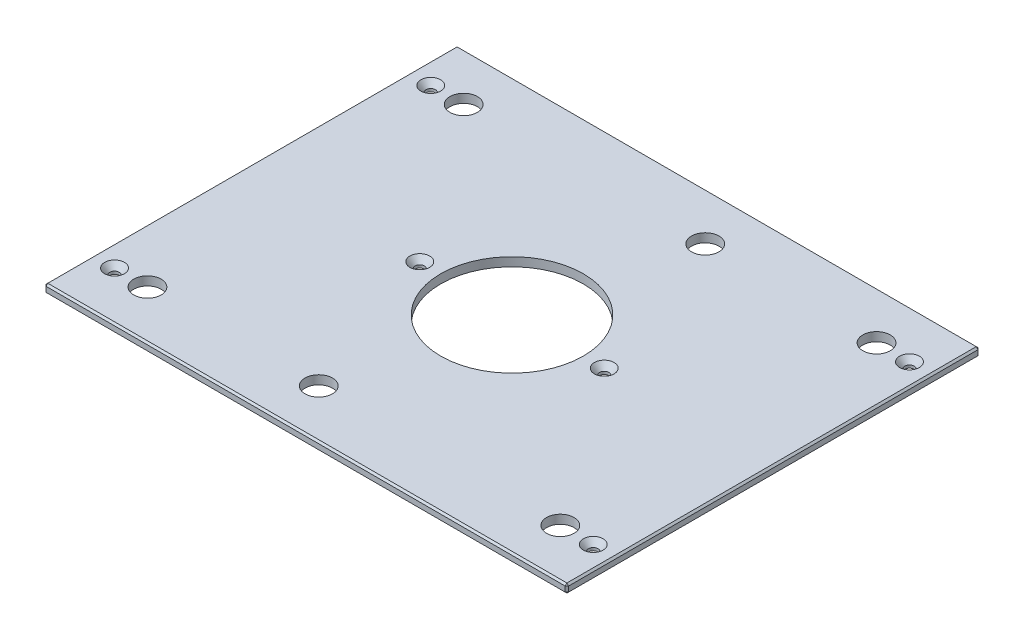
ISO-10303-21;
HEADER;
FILE_DESCRIPTION(('STEP AP214'),'2;1');
FILE_NAME('part.step','',(''),(''),'','','');
FILE_SCHEMA(('AUTOMOTIVE_DESIGN { 1 0 10303 214 1 1 1 1 }'));
ENDSEC;
DATA;
#1=APPLICATION_CONTEXT('core data for automotive mechanical design processes');
#2=APPLICATION_PROTOCOL_DEFINITION('international standard','automotive_design',2000,#1);
#3=PRODUCT_CONTEXT('',#1,'mechanical');
#4=PRODUCT('Part','Part','',(#3));
#5=PRODUCT_RELATED_PRODUCT_CATEGORY('part','',(#4));
#6=PRODUCT_DEFINITION_FORMATION('','',#4);
#7=PRODUCT_DEFINITION_CONTEXT('part definition',#1,'design');
#8=PRODUCT_DEFINITION('design','',#6,#7);
#9=PRODUCT_DEFINITION_SHAPE('','',#8);
#10=(LENGTH_UNIT() NAMED_UNIT(*) SI_UNIT(.MILLI.,.METRE.));
#11=(NAMED_UNIT(*) PLANE_ANGLE_UNIT() SI_UNIT($,.RADIAN.));
#12=(NAMED_UNIT(*) SI_UNIT($,.STERADIAN.) SOLID_ANGLE_UNIT());
#13=UNCERTAINTY_MEASURE_WITH_UNIT(LENGTH_MEASURE(1.E-05),#10,'distance_accuracy_value','');
#14=(GEOMETRIC_REPRESENTATION_CONTEXT(3) GLOBAL_UNCERTAINTY_ASSIGNED_CONTEXT((#13)) GLOBAL_UNIT_ASSIGNED_CONTEXT((#10,
#11,#12)) REPRESENTATION_CONTEXT('',''));
#15=CARTESIAN_POINT('',(0.,0.,0.));
#16=DIRECTION('',(0.,0.,1.));
#17=DIRECTION('',(1.,0.,0.));
#18=AXIS2_PLACEMENT_3D('',#15,#16,#17);
#19=CARTESIAN_POINT('',(-188.9125,6.35,-149.225));
#20=DIRECTION('',(1.,0.,0.));
#21=DIRECTION('',(0.,0.,-1.));
#22=AXIS2_PLACEMENT_3D('',#19,#20,#21);
#23=PLANE('',#22);
#24=DIRECTION('',(0.,0.,-1.));
#25=VECTOR('',#24,1.);
#26=CARTESIAN_POINT('',(-188.9125,5.08000000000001,-149.225));
#27=LINE('',#26,#25);
#28=CARTESIAN_POINT('',(-188.9125,5.08000000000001,147.955));
#29=VERTEX_POINT('',#28);
#30=CARTESIAN_POINT('',(-188.9125,5.08000000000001,-147.955));
#31=VERTEX_POINT('',#30);
#32=EDGE_CURVE('E134',#29,#31,#27,.T.);
#33=ORIENTED_EDGE('',*,*,#32,.T.);
#34=DIRECTION('',(0.,-1.,0.));
#35=VECTOR('',#34,1.);
#36=CARTESIAN_POINT('',(-188.9125,6.35,-147.955));
#37=LINE('',#36,#35);
#38=CARTESIAN_POINT('',(-188.9125,1.26999999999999,-147.955));
#39=VERTEX_POINT('',#38);
#40=EDGE_CURVE('E130',#31,#39,#37,.T.);
#41=ORIENTED_EDGE('',*,*,#40,.T.);
#42=DIRECTION('',(0.,0.,1.));
#43=VECTOR('',#42,1.);
#44=CARTESIAN_POINT('',(-188.9125,1.26999999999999,-149.225));
#45=LINE('',#44,#43);
#46=CARTESIAN_POINT('',(-188.9125,1.26999999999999,147.955));
#47=VERTEX_POINT('',#46);
#48=EDGE_CURVE('E125',#39,#47,#45,.T.);
#49=ORIENTED_EDGE('',*,*,#48,.T.);
#50=DIRECTION('',(0.,1.,0.));
#51=VECTOR('',#50,1.);
#52=CARTESIAN_POINT('',(-188.9125,6.35,147.955));
#53=LINE('',#52,#51);
#54=EDGE_CURVE('E127',#47,#29,#53,.T.);
#55=ORIENTED_EDGE('',*,*,#54,.T.);
#56=EDGE_LOOP('',(#33,#41,#49,#55));
#57=FACE_BOUND('',#56,.T.);
#58=ADVANCED_FACE('F34',(#57),#23,.F.);
#59=CARTESIAN_POINT('',(-188.9125,6.35,149.225));
#60=DIRECTION('',(0.,0.,-1.));
#61=DIRECTION('',(-1.,0.,0.));
#62=AXIS2_PLACEMENT_3D('',#59,#60,#61);
#63=PLANE('',#62);
#64=DIRECTION('',(1.,0.,0.));
#65=VECTOR('',#64,1.);
#66=CARTESIAN_POINT('',(-188.9125,1.26999999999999,149.225));
#67=LINE('',#66,#65);
#68=CARTESIAN_POINT('',(-187.6425,1.26999999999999,149.225));
#69=VERTEX_POINT('',#68);
#70=CARTESIAN_POINT('',(187.6425,1.26999999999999,149.225));
#71=VERTEX_POINT('',#70);
#72=EDGE_CURVE('E57',#69,#71,#67,.T.);
#73=ORIENTED_EDGE('',*,*,#72,.T.);
#74=DIRECTION('',(0.,1.,0.));
#75=VECTOR('',#74,1.);
#76=CARTESIAN_POINT('',(187.6425,6.35,149.225));
#77=LINE('',#76,#75);
#78=CARTESIAN_POINT('',(187.6425,5.08000000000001,149.225));
#79=VERTEX_POINT('',#78);
#80=EDGE_CURVE('E11',#71,#79,#77,.T.);
#81=ORIENTED_EDGE('',*,*,#80,.T.);
#82=DIRECTION('',(-1.,0.,0.));
#83=VECTOR('',#82,1.);
#84=CARTESIAN_POINT('',(-188.9125,5.08000000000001,149.225));
#85=LINE('',#84,#83);
#86=CARTESIAN_POINT('',(-187.6425,5.08000000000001,149.225));
#87=VERTEX_POINT('',#86);
#88=EDGE_CURVE('E43',#79,#87,#85,.T.);
#89=ORIENTED_EDGE('',*,*,#88,.T.);
#90=DIRECTION('',(0.,-1.,0.));
#91=VECTOR('',#90,1.);
#92=CARTESIAN_POINT('',(-187.6425,6.35,149.225));
#93=LINE('',#92,#91);
#94=EDGE_CURVE('E290',#87,#69,#93,.T.);
#95=ORIENTED_EDGE('',*,*,#94,.T.);
#96=EDGE_LOOP('',(#73,#81,#89,#95));
#97=FACE_BOUND('',#96,.T.);
#98=ADVANCED_FACE('F359',(#97),#63,.F.);
#99=CARTESIAN_POINT('',(188.9125,6.35,-149.225));
#100=DIRECTION('',(-1.,0.,0.));
#101=DIRECTION('',(0.,0.,1.));
#102=AXIS2_PLACEMENT_3D('',#99,#100,#101);
#103=PLANE('',#102);
#104=DIRECTION('',(0.,0.,-1.));
#105=VECTOR('',#104,1.);
#106=CARTESIAN_POINT('',(188.9125,1.26999999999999,-149.225));
#107=LINE('',#106,#105);
#108=CARTESIAN_POINT('',(188.9125,1.26999999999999,147.955));
#109=VERTEX_POINT('',#108);
#110=CARTESIAN_POINT('',(188.9125,1.26999999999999,-147.955));
#111=VERTEX_POINT('',#110);
#112=EDGE_CURVE('E285',#109,#111,#107,.T.);
#113=ORIENTED_EDGE('',*,*,#112,.T.);
#114=DIRECTION('',(0.,1.,0.));
#115=VECTOR('',#114,1.);
#116=CARTESIAN_POINT('',(188.9125,6.35,-147.955));
#117=LINE('',#116,#115);
#118=CARTESIAN_POINT('',(188.9125,5.08000000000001,-147.955));
#119=VERTEX_POINT('',#118);
#120=EDGE_CURVE('E287',#111,#119,#117,.T.);
#121=ORIENTED_EDGE('',*,*,#120,.T.);
#122=DIRECTION('',(0.,0.,1.));
#123=VECTOR('',#122,1.);
#124=CARTESIAN_POINT('',(188.9125,5.08000000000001,149.225));
#125=LINE('',#124,#123);
#126=CARTESIAN_POINT('',(188.9125,5.08000000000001,147.955));
#127=VERTEX_POINT('',#126);
#128=EDGE_CURVE('E283',#119,#127,#125,.T.);
#129=ORIENTED_EDGE('',*,*,#128,.T.);
#130=DIRECTION('',(0.,-1.,0.));
#131=VECTOR('',#130,1.);
#132=CARTESIAN_POINT('',(188.9125,6.35,147.955));
#133=LINE('',#132,#131);
#134=EDGE_CURVE('E281',#127,#109,#133,.T.);
#135=ORIENTED_EDGE('',*,*,#134,.T.);
#136=EDGE_LOOP('',(#113,#121,#129,#135));
#137=FACE_BOUND('',#136,.T.);
#138=ADVANCED_FACE('F346',(#137),#103,.F.);
#139=CARTESIAN_POINT('',(-188.9125,6.35,-149.225));
#140=DIRECTION('',(0.,0.,1.));
#141=DIRECTION('',(1.,0.,0.));
#142=AXIS2_PLACEMENT_3D('',#139,#140,#141);
#143=PLANE('',#142);
#144=DIRECTION('',(-1.,0.,0.));
#145=VECTOR('',#144,1.);
#146=CARTESIAN_POINT('',(-188.9125,1.26999999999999,-149.225));
#147=LINE('',#146,#145);
#148=CARTESIAN_POINT('',(187.6425,1.26999999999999,-149.225));
#149=VERTEX_POINT('',#148);
#150=CARTESIAN_POINT('',(-187.6425,1.26999999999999,-149.225));
#151=VERTEX_POINT('',#150);
#152=EDGE_CURVE('E257',#149,#151,#147,.T.);
#153=ORIENTED_EDGE('',*,*,#152,.T.);
#154=DIRECTION('',(0.,1.,0.));
#155=VECTOR('',#154,1.);
#156=CARTESIAN_POINT('',(-187.6425,6.35,-149.225));
#157=LINE('',#156,#155);
#158=CARTESIAN_POINT('',(-187.6425,5.08000000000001,-149.225));
#159=VERTEX_POINT('',#158);
#160=EDGE_CURVE('E261',#151,#159,#157,.T.);
#161=ORIENTED_EDGE('',*,*,#160,.T.);
#162=DIRECTION('',(1.,0.,0.));
#163=VECTOR('',#162,1.);
#164=CARTESIAN_POINT('',(188.9125,5.08000000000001,-149.225));
#165=LINE('',#164,#163);
#166=CARTESIAN_POINT('',(187.6425,5.08000000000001,-149.225));
#167=VERTEX_POINT('',#166);
#168=EDGE_CURVE('E259',#159,#167,#165,.T.);
#169=ORIENTED_EDGE('',*,*,#168,.T.);
#170=DIRECTION('',(0.,-1.,0.));
#171=VECTOR('',#170,1.);
#172=CARTESIAN_POINT('',(187.6425,6.35,-149.225));
#173=LINE('',#172,#171);
#174=EDGE_CURVE('E255',#167,#149,#173,.T.);
#175=ORIENTED_EDGE('',*,*,#174,.T.);
#176=EDGE_LOOP('',(#153,#161,#169,#175));
#177=FACE_BOUND('',#176,.T.);
#178=ADVANCED_FACE('F320',(#177),#143,.F.);
#179=CARTESIAN_POINT('',(0.,6.35,0.));
#180=DIRECTION('',(0.,1.,0.));
#181=DIRECTION('',(0.,0.,1.));
#182=AXIS2_PLACEMENT_3D('',#179,#180,#181);
#183=PLANE('',#182);
#184=CARTESIAN_POINT('',(173.0375,6.35,-114.3));
#185=DIRECTION('',(0.,1.,0.));
#186=DIRECTION('',(0.,0.,1.));
#187=AXIS2_PLACEMENT_3D('',#184,#185,#186);
#188=CIRCLE('',#187,7.13739999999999);
#189=CARTESIAN_POINT('',(173.0375,6.35,-107.1626));
#190=VERTEX_POINT('',#189);
#191=EDGE_CURVE('E783',#190,#190,#188,.T.);
#192=ORIENTED_EDGE('',*,*,#191,.F.);
#193=EDGE_LOOP('',(#192));
#194=FACE_BOUND('',#193,.T.);
#195=CARTESIAN_POINT('',(173.0375,6.35,114.3));
#196=DIRECTION('',(0.,1.,0.));
#197=DIRECTION('',(0.,0.,1.));
#198=AXIS2_PLACEMENT_3D('',#195,#196,#197);
#199=CIRCLE('',#198,7.13739999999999);
#200=CARTESIAN_POINT('',(173.0375,6.35,121.4374));
#201=VERTEX_POINT('',#200);
#202=EDGE_CURVE('E787',#201,#201,#199,.T.);
#203=ORIENTED_EDGE('',*,*,#202,.F.);
#204=EDGE_LOOP('',(#203));
#205=FACE_BOUND('',#204,.T.);
#206=CARTESIAN_POINT('',(-173.0375,6.35,114.3));
#207=DIRECTION('',(0.,1.,0.));
#208=DIRECTION('',(0.,0.,1.));
#209=AXIS2_PLACEMENT_3D('',#206,#207,#208);
#210=CIRCLE('',#209,7.13739999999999);
#211=CARTESIAN_POINT('',(-173.0375,6.35,121.4374));
#212=VERTEX_POINT('',#211);
#213=EDGE_CURVE('E791',#212,#212,#210,.T.);
#214=ORIENTED_EDGE('',*,*,#213,.F.);
#215=EDGE_LOOP('',(#214));
#216=FACE_BOUND('',#215,.T.);
#217=CARTESIAN_POINT('',(-66.675,6.35,0.));
#218=DIRECTION('',(0.,1.,0.));
#219=DIRECTION('',(0.,0.,1.));
#220=AXIS2_PLACEMENT_3D('',#217,#218,#219);
#221=CIRCLE('',#220,7.1374);
#222=CARTESIAN_POINT('',(-66.675,6.35,7.1374));
#223=VERTEX_POINT('',#222);
#224=EDGE_CURVE('E795',#223,#223,#221,.T.);
#225=ORIENTED_EDGE('',*,*,#224,.F.);
#226=EDGE_LOOP('',(#225));
#227=FACE_BOUND('',#226,.T.);
#228=CARTESIAN_POINT('',(66.675,6.35,0.));
#229=DIRECTION('',(0.,1.,0.));
#230=DIRECTION('',(0.,0.,1.));
#231=AXIS2_PLACEMENT_3D('',#228,#229,#230);
#232=CIRCLE('',#231,7.1374);
#233=CARTESIAN_POINT('',(66.675,6.35,7.1374));
#234=VERTEX_POINT('',#233);
#235=EDGE_CURVE('E799',#234,#234,#232,.T.);
#236=ORIENTED_EDGE('',*,*,#235,.F.);
#237=EDGE_LOOP('',(#236));
#238=FACE_BOUND('',#237,.T.);
#239=CARTESIAN_POINT('',(-173.0375,6.35,-114.3));
#240=DIRECTION('',(0.,1.,0.));
#241=DIRECTION('',(0.,0.,1.));
#242=AXIS2_PLACEMENT_3D('',#239,#240,#241);
#243=CIRCLE('',#242,7.13739999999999);
#244=CARTESIAN_POINT('',(-173.0375,6.35,-107.1626));
#245=VERTEX_POINT('',#244);
#246=EDGE_CURVE('E802',#245,#245,#243,.T.);
#247=ORIENTED_EDGE('',*,*,#246,.F.);
#248=EDGE_LOOP('',(#247));
#249=FACE_BOUND('',#248,.T.);
#250=DIRECTION('',(0.,0.,-1.));
#251=VECTOR('',#250,1.);
#252=CARTESIAN_POINT('',(187.6425,6.35,-149.225));
#253=LINE('',#252,#251);
#254=CARTESIAN_POINT('',(187.6425,6.35,147.955));
#255=VERTEX_POINT('',#254);
#256=CARTESIAN_POINT('',(187.6425,6.35,-147.955));
#257=VERTEX_POINT('',#256);
#258=EDGE_CURVE('E268',#255,#257,#253,.T.);
#259=ORIENTED_EDGE('',*,*,#258,.T.);
#260=DIRECTION('',(-1.,0.,0.));
#261=VECTOR('',#260,1.);
#262=CARTESIAN_POINT('',(-188.9125,6.35,-147.955));
#263=LINE('',#262,#261);
#264=CARTESIAN_POINT('',(-187.6425,6.35,-147.955));
#265=VERTEX_POINT('',#264);
#266=EDGE_CURVE('E270',#257,#265,#263,.T.);
#267=ORIENTED_EDGE('',*,*,#266,.T.);
#268=DIRECTION('',(0.,0.,1.));
#269=VECTOR('',#268,1.);
#270=CARTESIAN_POINT('',(-187.6425,6.35,149.225));
#271=LINE('',#270,#269);
#272=CARTESIAN_POINT('',(-187.6425,6.35,147.955));
#273=VERTEX_POINT('',#272);
#274=EDGE_CURVE('E266',#265,#273,#271,.T.);
#275=ORIENTED_EDGE('',*,*,#274,.T.);
#276=DIRECTION('',(1.,0.,0.));
#277=VECTOR('',#276,1.);
#278=CARTESIAN_POINT('',(188.9125,6.35,147.955));
#279=LINE('',#278,#277);
#280=EDGE_CURVE('E264',#273,#255,#279,.T.);
#281=ORIENTED_EDGE('',*,*,#280,.T.);
#282=EDGE_LOOP('',(#259,#267,#275,#281));
#283=FACE_BOUND('',#282,.T.);
#284=CARTESIAN_POINT('',(149.225,6.35,-114.3));
#285=DIRECTION('',(0.,1.,0.));
#286=DIRECTION('',(0.,0.,1.));
#287=AXIS2_PLACEMENT_3D('',#284,#285,#286);
#288=CIRCLE('',#287,9.921875);
#289=CARTESIAN_POINT('',(149.225,6.35,-104.378125));
#290=VERTEX_POINT('',#289);
#291=EDGE_CURVE('E203',#290,#290,#288,.T.);
#292=ORIENTED_EDGE('',*,*,#291,.F.);
#293=EDGE_LOOP('',(#292));
#294=FACE_BOUND('',#293,.T.);
#295=CARTESIAN_POINT('',(-149.225,6.35,-114.3));
#296=DIRECTION('',(0.,1.,0.));
#297=DIRECTION('',(0.,0.,1.));
#298=AXIS2_PLACEMENT_3D('',#295,#296,#297);
#299=CIRCLE('',#298,9.921875);
#300=CARTESIAN_POINT('',(-149.225,6.35,-104.378125));
#301=VERTEX_POINT('',#300);
#302=EDGE_CURVE('E213',#301,#301,#299,.T.);
#303=ORIENTED_EDGE('',*,*,#302,.F.);
#304=EDGE_LOOP('',(#303));
#305=FACE_BOUND('',#304,.T.);
#306=CARTESIAN_POINT('',(149.225,6.35,114.3));
#307=DIRECTION('',(0.,1.,0.));
#308=DIRECTION('',(0.,0.,1.));
#309=AXIS2_PLACEMENT_3D('',#306,#307,#308);
#310=CIRCLE('',#309,9.921875);
#311=CARTESIAN_POINT('',(149.225,6.35,124.221875));
#312=VERTEX_POINT('',#311);
#313=EDGE_CURVE('E224',#312,#312,#310,.T.);
#314=ORIENTED_EDGE('',*,*,#313,.F.);
#315=EDGE_LOOP('',(#314));
#316=FACE_BOUND('',#315,.T.);
#317=CARTESIAN_POINT('',(-149.225,6.35,114.3));
#318=DIRECTION('',(0.,1.,0.));
#319=DIRECTION('',(0.,0.,1.));
#320=AXIS2_PLACEMENT_3D('',#317,#318,#319);
#321=CIRCLE('',#320,9.921875);
#322=CARTESIAN_POINT('',(-149.225,6.35,124.221875));
#323=VERTEX_POINT('',#322);
#324=EDGE_CURVE('E230',#323,#323,#321,.T.);
#325=ORIENTED_EDGE('',*,*,#324,.F.);
#326=EDGE_LOOP('',(#325));
#327=FACE_BOUND('',#326,.T.);
#328=CARTESIAN_POINT('',(25.4,6.35,-114.3));
#329=DIRECTION('',(0.,1.,0.));
#330=DIRECTION('',(0.,0.,1.));
#331=AXIS2_PLACEMENT_3D('',#328,#329,#330);
#332=CIRCLE('',#331,9.921875);
#333=CARTESIAN_POINT('',(25.4,6.35,-104.378125));
#334=VERTEX_POINT('',#333);
#335=EDGE_CURVE('E236',#334,#334,#332,.T.);
#336=ORIENTED_EDGE('',*,*,#335,.F.);
#337=EDGE_LOOP('',(#336));
#338=FACE_BOUND('',#337,.T.);
#339=CARTESIAN_POINT('',(-25.4,6.35,114.3));
#340=DIRECTION('',(0.,1.,0.));
#341=DIRECTION('',(0.,0.,1.));
#342=AXIS2_PLACEMENT_3D('',#339,#340,#341);
#343=CIRCLE('',#342,9.921875);
#344=CARTESIAN_POINT('',(-25.4,6.35,124.221875));
#345=VERTEX_POINT('',#344);
#346=EDGE_CURVE('E242',#345,#345,#343,.T.);
#347=ORIENTED_EDGE('',*,*,#346,.F.);
#348=EDGE_LOOP('',(#347));
#349=FACE_BOUND('',#348,.T.);
#350=CARTESIAN_POINT('',(0.,6.35,0.));
#351=DIRECTION('',(0.,1.,0.));
#352=DIRECTION('',(0.,0.,1.));
#353=AXIS2_PLACEMENT_3D('',#350,#351,#352);
#354=CIRCLE('',#353,51.562);
#355=CARTESIAN_POINT('',(0.,6.35,51.562));
#356=VERTEX_POINT('',#355);
#357=EDGE_CURVE('E248',#356,#356,#354,.T.);
#358=ORIENTED_EDGE('',*,*,#357,.F.);
#359=EDGE_LOOP('',(#358));
#360=FACE_BOUND('',#359,.T.);
#361=ADVANCED_FACE('F368',(#194,#205,#216,#227,#238,#249,#283,#294,#305,#316,#327,#338,#349,
#360),#183,.T.);
#362=CARTESIAN_POINT('',(0.,0.,0.));
#363=DIRECTION('',(0.,1.,0.));
#364=DIRECTION('',(0.,0.,1.));
#365=AXIS2_PLACEMENT_3D('',#362,#363,#364);
#366=PLANE('',#365);
#367=CARTESIAN_POINT('',(173.0375,0.,-114.3));
#368=DIRECTION('',(0.,1.,0.));
#369=DIRECTION('',(0.,0.,1.));
#370=AXIS2_PLACEMENT_3D('',#367,#368,#369);
#371=CIRCLE('',#370,3.3782);
#372=CARTESIAN_POINT('',(173.0375,0.,-110.9218));
#373=VERTEX_POINT('',#372);
#374=EDGE_CURVE('E836',#373,#373,#371,.T.);
#375=ORIENTED_EDGE('',*,*,#374,.T.);
#376=EDGE_LOOP('',(#375));
#377=FACE_BOUND('',#376,.T.);
#378=CARTESIAN_POINT('',(173.0375,0.,114.3));
#379=DIRECTION('',(0.,1.,0.));
#380=DIRECTION('',(0.,0.,1.));
#381=AXIS2_PLACEMENT_3D('',#378,#379,#380);
#382=CIRCLE('',#381,3.3782);
#383=CARTESIAN_POINT('',(173.0375,0.,117.6782));
#384=VERTEX_POINT('',#383);
#385=EDGE_CURVE('E829',#384,#384,#382,.T.);
#386=ORIENTED_EDGE('',*,*,#385,.T.);
#387=EDGE_LOOP('',(#386));
#388=FACE_BOUND('',#387,.T.);
#389=CARTESIAN_POINT('',(-173.0375,0.,114.3));
#390=DIRECTION('',(0.,1.,0.));
#391=DIRECTION('',(0.,0.,1.));
#392=AXIS2_PLACEMENT_3D('',#389,#390,#391);
#393=CIRCLE('',#392,3.3782);
#394=CARTESIAN_POINT('',(-173.0375,0.,117.6782));
#395=VERTEX_POINT('',#394);
#396=EDGE_CURVE('E822',#395,#395,#393,.T.);
#397=ORIENTED_EDGE('',*,*,#396,.T.);
#398=EDGE_LOOP('',(#397));
#399=FACE_BOUND('',#398,.T.);
#400=CARTESIAN_POINT('',(-66.675,0.,0.));
#401=DIRECTION('',(0.,1.,0.));
#402=DIRECTION('',(0.,0.,1.));
#403=AXIS2_PLACEMENT_3D('',#400,#401,#402);
#404=CIRCLE('',#403,3.3782);
#405=CARTESIAN_POINT('',(-66.675,0.,3.3782));
#406=VERTEX_POINT('',#405);
#407=EDGE_CURVE('E815',#406,#406,#404,.T.);
#408=ORIENTED_EDGE('',*,*,#407,.T.);
#409=EDGE_LOOP('',(#408));
#410=FACE_BOUND('',#409,.T.);
#411=CARTESIAN_POINT('',(66.675,0.,0.));
#412=DIRECTION('',(0.,1.,0.));
#413=DIRECTION('',(0.,0.,1.));
#414=AXIS2_PLACEMENT_3D('',#411,#412,#413);
#415=CIRCLE('',#414,3.3782);
#416=CARTESIAN_POINT('',(66.675,0.,3.3782));
#417=VERTEX_POINT('',#416);
#418=EDGE_CURVE('E805',#417,#417,#415,.T.);
#419=ORIENTED_EDGE('',*,*,#418,.T.);
#420=EDGE_LOOP('',(#419));
#421=FACE_BOUND('',#420,.T.);
#422=CARTESIAN_POINT('',(-173.0375,0.,-114.3));
#423=DIRECTION('',(0.,1.,0.));
#424=DIRECTION('',(0.,0.,1.));
#425=AXIS2_PLACEMENT_3D('',#422,#423,#424);
#426=CIRCLE('',#425,3.3782);
#427=CARTESIAN_POINT('',(-173.0375,0.,-110.9218));
#428=VERTEX_POINT('',#427);
#429=EDGE_CURVE('E216',#428,#428,#426,.T.);
#430=ORIENTED_EDGE('',*,*,#429,.T.);
#431=EDGE_LOOP('',(#430));
#432=FACE_BOUND('',#431,.T.);
#433=DIRECTION('',(0.,0.,-1.));
#434=VECTOR('',#433,1.);
#435=CARTESIAN_POINT('',(-187.6425,0.,0.));
#436=LINE('',#435,#434);
#437=CARTESIAN_POINT('',(-187.6425,0.,147.955));
#438=VERTEX_POINT('',#437);
#439=CARTESIAN_POINT('',(-187.6425,0.,-147.955));
#440=VERTEX_POINT('',#439);
#441=EDGE_CURVE('E157',#438,#440,#436,.T.);
#442=ORIENTED_EDGE('',*,*,#441,.T.);
#443=DIRECTION('',(1.,0.,0.));
#444=VECTOR('',#443,1.);
#445=CARTESIAN_POINT('',(0.,0.,-147.955));
#446=LINE('',#445,#444);
#447=CARTESIAN_POINT('',(187.6425,0.,-147.955));
#448=VERTEX_POINT('',#447);
#449=EDGE_CURVE('E278',#440,#448,#446,.T.);
#450=ORIENTED_EDGE('',*,*,#449,.T.);
#451=DIRECTION('',(0.,0.,1.));
#452=VECTOR('',#451,1.);
#453=CARTESIAN_POINT('',(187.6425,0.,0.));
#454=LINE('',#453,#452);
#455=CARTESIAN_POINT('',(187.6425,0.,147.955));
#456=VERTEX_POINT('',#455);
#457=EDGE_CURVE('E276',#448,#456,#454,.T.);
#458=ORIENTED_EDGE('',*,*,#457,.T.);
#459=DIRECTION('',(-1.,0.,0.));
#460=VECTOR('',#459,1.);
#461=CARTESIAN_POINT('',(0.,0.,147.955));
#462=LINE('',#461,#460);
#463=EDGE_CURVE('E273',#456,#438,#462,.T.);
#464=ORIENTED_EDGE('',*,*,#463,.T.);
#465=EDGE_LOOP('',(#442,#450,#458,#464));
#466=FACE_BOUND('',#465,.T.);
#467=CARTESIAN_POINT('',(149.225,0.,-114.3));
#468=DIRECTION('',(0.,1.,0.));
#469=DIRECTION('',(0.,0.,1.));
#470=AXIS2_PLACEMENT_3D('',#467,#468,#469);
#471=CIRCLE('',#470,9.921875);
#472=CARTESIAN_POINT('',(149.225,0.,-104.378125));
#473=VERTEX_POINT('',#472);
#474=EDGE_CURVE('E208',#473,#473,#471,.T.);
#475=ORIENTED_EDGE('',*,*,#474,.T.);
#476=EDGE_LOOP('',(#475));
#477=FACE_BOUND('',#476,.T.);
#478=CARTESIAN_POINT('',(-149.225,0.,-114.3));
#479=DIRECTION('',(0.,1.,0.));
#480=DIRECTION('',(0.,0.,1.));
#481=AXIS2_PLACEMENT_3D('',#478,#479,#480);
#482=CIRCLE('',#481,9.921875);
#483=CARTESIAN_POINT('',(-149.225,0.,-104.378125));
#484=VERTEX_POINT('',#483);
#485=EDGE_CURVE('E221',#484,#484,#482,.T.);
#486=ORIENTED_EDGE('',*,*,#485,.T.);
#487=EDGE_LOOP('',(#486));
#488=FACE_BOUND('',#487,.T.);
#489=CARTESIAN_POINT('',(149.225,0.,114.3));
#490=DIRECTION('',(0.,1.,0.));
#491=DIRECTION('',(0.,0.,1.));
#492=AXIS2_PLACEMENT_3D('',#489,#490,#491);
#493=CIRCLE('',#492,9.921875);
#494=CARTESIAN_POINT('',(149.225,0.,124.221875));
#495=VERTEX_POINT('',#494);
#496=EDGE_CURVE('E227',#495,#495,#493,.T.);
#497=ORIENTED_EDGE('',*,*,#496,.T.);
#498=EDGE_LOOP('',(#497));
#499=FACE_BOUND('',#498,.T.);
#500=CARTESIAN_POINT('',(-149.225,0.,114.3));
#501=DIRECTION('',(0.,1.,0.));
#502=DIRECTION('',(0.,0.,1.));
#503=AXIS2_PLACEMENT_3D('',#500,#501,#502);
#504=CIRCLE('',#503,9.921875);
#505=CARTESIAN_POINT('',(-149.225,0.,124.221875));
#506=VERTEX_POINT('',#505);
#507=EDGE_CURVE('E233',#506,#506,#504,.T.);
#508=ORIENTED_EDGE('',*,*,#507,.T.);
#509=EDGE_LOOP('',(#508));
#510=FACE_BOUND('',#509,.T.);
#511=CARTESIAN_POINT('',(25.4,0.,-114.3));
#512=DIRECTION('',(0.,1.,0.));
#513=DIRECTION('',(0.,0.,1.));
#514=AXIS2_PLACEMENT_3D('',#511,#512,#513);
#515=CIRCLE('',#514,9.921875);
#516=CARTESIAN_POINT('',(25.4,0.,-104.378125));
#517=VERTEX_POINT('',#516);
#518=EDGE_CURVE('E239',#517,#517,#515,.T.);
#519=ORIENTED_EDGE('',*,*,#518,.T.);
#520=EDGE_LOOP('',(#519));
#521=FACE_BOUND('',#520,.T.);
#522=CARTESIAN_POINT('',(-25.4,0.,114.3));
#523=DIRECTION('',(0.,1.,0.));
#524=DIRECTION('',(0.,0.,1.));
#525=AXIS2_PLACEMENT_3D('',#522,#523,#524);
#526=CIRCLE('',#525,9.921875);
#527=CARTESIAN_POINT('',(-25.4,0.,124.221875));
#528=VERTEX_POINT('',#527);
#529=EDGE_CURVE('E245',#528,#528,#526,.T.);
#530=ORIENTED_EDGE('',*,*,#529,.T.);
#531=EDGE_LOOP('',(#530));
#532=FACE_BOUND('',#531,.T.);
#533=CARTESIAN_POINT('',(0.,0.,0.));
#534=DIRECTION('',(0.,1.,0.));
#535=DIRECTION('',(0.,0.,1.));
#536=AXIS2_PLACEMENT_3D('',#533,#534,#535);
#537=CIRCLE('',#536,51.562);
#538=CARTESIAN_POINT('',(0.,0.,51.562));
#539=VERTEX_POINT('',#538);
#540=EDGE_CURVE('E146',#539,#539,#537,.T.);
#541=ORIENTED_EDGE('',*,*,#540,.T.);
#542=EDGE_LOOP('',(#541));
#543=FACE_BOUND('',#542,.T.);
#544=ADVANCED_FACE('F333',(#377,#388,#399,#410,#421,#432,#466,#477,#488,#499,#510,#521,#532,
#543),#366,.F.);
#545=CARTESIAN_POINT('',(0.,0.,0.));
#546=DIRECTION('',(0.,1.,0.));
#547=DIRECTION('',(0.,0.,1.));
#548=AXIS2_PLACEMENT_3D('',#545,#546,#547);
#549=CYLINDRICAL_SURFACE('',#548,51.562);
#550=ORIENTED_EDGE('',*,*,#540,.F.);
#551=EDGE_LOOP('',(#550));
#552=FACE_BOUND('',#551,.T.);
#553=ORIENTED_EDGE('',*,*,#357,.T.);
#554=EDGE_LOOP('',(#553));
#555=FACE_BOUND('',#554,.T.);
#556=ADVANCED_FACE('F720',(#552,#555),#549,.F.);
#557=CARTESIAN_POINT('',(-25.4,6.35,114.3));
#558=DIRECTION('',(0.,1.,0.));
#559=DIRECTION('',(0.,0.,1.));
#560=AXIS2_PLACEMENT_3D('',#557,#558,#559);
#561=CYLINDRICAL_SURFACE('',#560,9.921875);
#562=ORIENTED_EDGE('',*,*,#529,.F.);
#563=EDGE_LOOP('',(#562));
#564=FACE_BOUND('',#563,.T.);
#565=ORIENTED_EDGE('',*,*,#346,.T.);
#566=EDGE_LOOP('',(#565));
#567=FACE_BOUND('',#566,.T.);
#568=ADVANCED_FACE('F711',(#564,#567),#561,.F.);
#569=CARTESIAN_POINT('',(25.4,6.35,-114.3));
#570=DIRECTION('',(0.,1.,0.));
#571=DIRECTION('',(0.,0.,1.));
#572=AXIS2_PLACEMENT_3D('',#569,#570,#571);
#573=CYLINDRICAL_SURFACE('',#572,9.921875);
#574=ORIENTED_EDGE('',*,*,#518,.F.);
#575=EDGE_LOOP('',(#574));
#576=FACE_BOUND('',#575,.T.);
#577=ORIENTED_EDGE('',*,*,#335,.T.);
#578=EDGE_LOOP('',(#577));
#579=FACE_BOUND('',#578,.T.);
#580=ADVANCED_FACE('F702',(#576,#579),#573,.F.);
#581=CARTESIAN_POINT('',(-149.225,6.35,114.3));
#582=DIRECTION('',(0.,1.,0.));
#583=DIRECTION('',(0.,0.,1.));
#584=AXIS2_PLACEMENT_3D('',#581,#582,#583);
#585=CYLINDRICAL_SURFACE('',#584,9.921875);
#586=ORIENTED_EDGE('',*,*,#507,.F.);
#587=EDGE_LOOP('',(#586));
#588=FACE_BOUND('',#587,.T.);
#589=ORIENTED_EDGE('',*,*,#324,.T.);
#590=EDGE_LOOP('',(#589));
#591=FACE_BOUND('',#590,.T.);
#592=ADVANCED_FACE('F693',(#588,#591),#585,.F.);
#593=CARTESIAN_POINT('',(149.225,6.35,114.3));
#594=DIRECTION('',(0.,1.,0.));
#595=DIRECTION('',(0.,0.,1.));
#596=AXIS2_PLACEMENT_3D('',#593,#594,#595);
#597=CYLINDRICAL_SURFACE('',#596,9.921875);
#598=ORIENTED_EDGE('',*,*,#496,.F.);
#599=EDGE_LOOP('',(#598));
#600=FACE_BOUND('',#599,.T.);
#601=ORIENTED_EDGE('',*,*,#313,.T.);
#602=EDGE_LOOP('',(#601));
#603=FACE_BOUND('',#602,.T.);
#604=ADVANCED_FACE('F684',(#600,#603),#597,.F.);
#605=CARTESIAN_POINT('',(-149.225,6.35,-114.3));
#606=DIRECTION('',(0.,1.,0.));
#607=DIRECTION('',(0.,0.,1.));
#608=AXIS2_PLACEMENT_3D('',#605,#606,#607);
#609=CYLINDRICAL_SURFACE('',#608,9.921875);
#610=ORIENTED_EDGE('',*,*,#485,.F.);
#611=EDGE_LOOP('',(#610));
#612=FACE_BOUND('',#611,.T.);
#613=ORIENTED_EDGE('',*,*,#302,.T.);
#614=EDGE_LOOP('',(#613));
#615=FACE_BOUND('',#614,.T.);
#616=ADVANCED_FACE('F674',(#612,#615),#609,.F.);
#617=CARTESIAN_POINT('',(149.225,6.35,-114.3));
#618=DIRECTION('',(0.,1.,0.));
#619=DIRECTION('',(0.,0.,1.));
#620=AXIS2_PLACEMENT_3D('',#617,#618,#619);
#621=CYLINDRICAL_SURFACE('',#620,9.921875);
#622=ORIENTED_EDGE('',*,*,#474,.F.);
#623=EDGE_LOOP('',(#622));
#624=FACE_BOUND('',#623,.T.);
#625=ORIENTED_EDGE('',*,*,#291,.T.);
#626=EDGE_LOOP('',(#625));
#627=FACE_BOUND('',#626,.T.);
#628=ADVANCED_FACE('F377',(#624,#627),#621,.F.);
#629=CARTESIAN_POINT('',(188.9125,6.35,147.955));
#630=DIRECTION('',(-0.707106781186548,0.,-0.707106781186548));
#631=DIRECTION('',(0.,-1.,0.));
#632=AXIS2_PLACEMENT_3D('',#629,#630,#631);
#633=PLANE('',#632);
#634=DIRECTION('',(-0.707106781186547,0.,0.707106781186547));
#635=VECTOR('',#634,1.);
#636=CARTESIAN_POINT('',(188.9125,5.08000000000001,147.955));
#637=LINE('',#636,#635);
#638=EDGE_CURVE('E38',#79,#127,#637,.F.);
#639=ORIENTED_EDGE('',*,*,#638,.F.);
#640=ORIENTED_EDGE('',*,*,#80,.F.);
#641=DIRECTION('',(0.707106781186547,0.,-0.707106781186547));
#642=VECTOR('',#641,1.);
#643=CARTESIAN_POINT('',(188.2775,1.26999999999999,148.59));
#644=LINE('',#643,#642);
#645=EDGE_CURVE('E196',#109,#71,#644,.F.);
#646=ORIENTED_EDGE('',*,*,#645,.F.);
#647=ORIENTED_EDGE('',*,*,#134,.F.);
#648=EDGE_LOOP('',(#639,#640,#646,#647));
#649=FACE_BOUND('',#648,.T.);
#650=ADVANCED_FACE('F36',(#649),#633,.F.);
#651=CARTESIAN_POINT('',(188.9125,5.08000000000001,147.955));
#652=DIRECTION('',(0.577350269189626,0.577350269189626,0.577350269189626));
#653=DIRECTION('',(0.707106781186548,0.,-0.707106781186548));
#654=AXIS2_PLACEMENT_3D('',#651,#652,#653);
#655=PLANE('',#654);
#656=DIRECTION('',(0.,-0.707106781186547,0.707106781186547));
#657=VECTOR('',#656,1.);
#658=CARTESIAN_POINT('',(187.6425,5.715,148.59));
#659=LINE('',#658,#657);
#660=EDGE_CURVE('E192',#79,#255,#659,.F.);
#661=ORIENTED_EDGE('',*,*,#660,.F.);
#662=ORIENTED_EDGE('',*,*,#638,.T.);
#663=DIRECTION('',(-0.707106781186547,0.707106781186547,0.));
#664=VECTOR('',#663,1.);
#665=CARTESIAN_POINT('',(188.9125,5.08000000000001,147.955));
#666=LINE('',#665,#664);
#667=EDGE_CURVE('E194',#255,#127,#666,.F.);
#668=ORIENTED_EDGE('',*,*,#667,.F.);
#669=EDGE_LOOP('',(#661,#662,#668));
#670=FACE_BOUND('',#669,.T.);
#671=ADVANCED_FACE('F370',(#670),#655,.T.);
#672=CARTESIAN_POINT('',(187.6425,0.,147.955));
#673=DIRECTION('',(0.577350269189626,-0.577350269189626,0.577350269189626));
#674=DIRECTION('',(0.707106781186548,0.,-0.707106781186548));
#675=AXIS2_PLACEMENT_3D('',#672,#673,#674);
#676=PLANE('',#675);
#677=DIRECTION('',(-0.707106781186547,-0.707106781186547,0.));
#678=VECTOR('',#677,1.);
#679=CARTESIAN_POINT('',(187.6425,0.,147.955));
#680=LINE('',#679,#678);
#681=EDGE_CURVE('E186',#109,#456,#680,.T.);
#682=ORIENTED_EDGE('',*,*,#681,.F.);
#683=ORIENTED_EDGE('',*,*,#645,.T.);
#684=DIRECTION('',(0.,0.707106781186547,0.707106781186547));
#685=VECTOR('',#684,1.);
#686=CARTESIAN_POINT('',(187.6425,0.,147.955));
#687=LINE('',#686,#685);
#688=EDGE_CURVE('E189',#456,#71,#687,.T.);
#689=ORIENTED_EDGE('',*,*,#688,.F.);
#690=EDGE_LOOP('',(#682,#683,#689));
#691=FACE_BOUND('',#690,.T.);
#692=ADVANCED_FACE('F339',(#691),#676,.T.);
#693=CARTESIAN_POINT('',(187.6425,6.35,0.));
#694=DIRECTION('',(0.707106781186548,0.707106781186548,0.));
#695=DIRECTION('',(0.,0.,1.));
#696=AXIS2_PLACEMENT_3D('',#693,#694,#695);
#697=PLANE('',#696);
#698=ORIENTED_EDGE('',*,*,#667,.T.);
#699=ORIENTED_EDGE('',*,*,#128,.F.);
#700=DIRECTION('',(0.707106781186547,-0.707106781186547,0.));
#701=VECTOR('',#700,1.);
#702=CARTESIAN_POINT('',(188.2775,5.715,-147.955));
#703=LINE('',#702,#701);
#704=EDGE_CURVE('E181',#257,#119,#703,.T.);
#705=ORIENTED_EDGE('',*,*,#704,.F.);
#706=ORIENTED_EDGE('',*,*,#258,.F.);
#707=EDGE_LOOP('',(#698,#699,#705,#706));
#708=FACE_BOUND('',#707,.T.);
#709=ADVANCED_FACE('F356',(#708),#697,.T.);
#710=CARTESIAN_POINT('',(0.,6.35,147.955));
#711=DIRECTION('',(0.,0.707106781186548,0.707106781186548));
#712=DIRECTION('',(-1.,0.,0.));
#713=AXIS2_PLACEMENT_3D('',#710,#711,#712);
#714=PLANE('',#713);
#715=ORIENTED_EDGE('',*,*,#660,.T.);
#716=ORIENTED_EDGE('',*,*,#280,.F.);
#717=DIRECTION('',(0.,0.707106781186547,-0.707106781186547));
#718=VECTOR('',#717,1.);
#719=CARTESIAN_POINT('',(-187.6425,6.35,147.955));
#720=LINE('',#719,#718);
#721=EDGE_CURVE('E178',#87,#273,#720,.T.);
#722=ORIENTED_EDGE('',*,*,#721,.F.);
#723=ORIENTED_EDGE('',*,*,#88,.F.);
#724=EDGE_LOOP('',(#715,#716,#722,#723));
#725=FACE_BOUND('',#724,.T.);
#726=ADVANCED_FACE('F361',(#725),#714,.T.);
#727=CARTESIAN_POINT('',(-187.6425,6.35,149.225));
#728=DIRECTION('',(0.707106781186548,0.,-0.707106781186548));
#729=DIRECTION('',(0.,-1.,0.));
#730=AXIS2_PLACEMENT_3D('',#727,#728,#729);
#731=PLANE('',#730);
#732=DIRECTION('',(0.707106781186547,0.,0.707106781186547));
#733=VECTOR('',#732,1.);
#734=CARTESIAN_POINT('',(-188.9125,1.26999999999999,147.955));
#735=LINE('',#734,#733);
#736=EDGE_CURVE('E141',#69,#47,#735,.F.);
#737=ORIENTED_EDGE('',*,*,#736,.F.);
#738=ORIENTED_EDGE('',*,*,#94,.F.);
#739=DIRECTION('',(-0.707106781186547,0.,-0.707106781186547));
#740=VECTOR('',#739,1.);
#741=CARTESIAN_POINT('',(-188.2775,5.08000000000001,148.59));
#742=LINE('',#741,#740);
#743=EDGE_CURVE('E144',#29,#87,#742,.F.);
#744=ORIENTED_EDGE('',*,*,#743,.F.);
#745=ORIENTED_EDGE('',*,*,#54,.F.);
#746=EDGE_LOOP('',(#737,#738,#744,#745));
#747=FACE_BOUND('',#746,.T.);
#748=ADVANCED_FACE('F139',(#747),#731,.F.);
#749=CARTESIAN_POINT('',(-188.9125,1.26999999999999,149.225));
#750=DIRECTION('',(0.,0.707106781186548,-0.707106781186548));
#751=DIRECTION('',(1.,0.,0.));
#752=AXIS2_PLACEMENT_3D('',#749,#750,#751);
#753=PLANE('',#752);
#754=ORIENTED_EDGE('',*,*,#688,.T.);
#755=ORIENTED_EDGE('',*,*,#72,.F.);
#756=DIRECTION('',(0.,-0.707106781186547,-0.707106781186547));
#757=VECTOR('',#756,1.);
#758=CARTESIAN_POINT('',(-187.6425,0.634999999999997,148.59));
#759=LINE('',#758,#757);
#760=EDGE_CURVE('E154',#438,#69,#759,.F.);
#761=ORIENTED_EDGE('',*,*,#760,.F.);
#762=ORIENTED_EDGE('',*,*,#463,.F.);
#763=EDGE_LOOP('',(#754,#755,#761,#762));
#764=FACE_BOUND('',#763,.T.);
#765=ADVANCED_FACE('F338',(#764),#753,.F.);
#766=CARTESIAN_POINT('',(188.9125,1.26999999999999,-149.225));
#767=DIRECTION('',(-0.707106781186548,0.707106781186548,0.));
#768=DIRECTION('',(0.,0.,-1.));
#769=AXIS2_PLACEMENT_3D('',#766,#767,#768);
#770=PLANE('',#769);
#771=ORIENTED_EDGE('',*,*,#681,.T.);
#772=ORIENTED_EDGE('',*,*,#457,.F.);
#773=DIRECTION('',(0.707106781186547,0.707106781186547,0.));
#774=VECTOR('',#773,1.);
#775=CARTESIAN_POINT('',(187.6425,0.,-147.955));
#776=LINE('',#775,#774);
#777=EDGE_CURVE('E173',#111,#448,#776,.F.);
#778=ORIENTED_EDGE('',*,*,#777,.F.);
#779=ORIENTED_EDGE('',*,*,#112,.F.);
#780=EDGE_LOOP('',(#771,#772,#778,#779));
#781=FACE_BOUND('',#780,.T.);
#782=ADVANCED_FACE('F343',(#781),#770,.F.);
#783=CARTESIAN_POINT('',(187.6425,6.35,-149.225));
#784=DIRECTION('',(-0.707106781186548,0.,0.707106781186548));
#785=DIRECTION('',(0.,-1.,0.));
#786=AXIS2_PLACEMENT_3D('',#783,#784,#785);
#787=PLANE('',#786);
#788=DIRECTION('',(0.707106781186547,0.,0.707106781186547));
#789=VECTOR('',#788,1.);
#790=CARTESIAN_POINT('',(187.6425,5.08000000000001,-149.225));
#791=LINE('',#790,#789);
#792=EDGE_CURVE('E183',#119,#167,#791,.F.);
#793=ORIENTED_EDGE('',*,*,#792,.F.);
#794=ORIENTED_EDGE('',*,*,#120,.F.);
#795=DIRECTION('',(-0.707106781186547,0.,-0.707106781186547));
#796=VECTOR('',#795,1.);
#797=CARTESIAN_POINT('',(188.2775,1.26999999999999,-148.59));
#798=LINE('',#797,#796);
#799=EDGE_CURVE('E170',#149,#111,#798,.F.);
#800=ORIENTED_EDGE('',*,*,#799,.F.);
#801=ORIENTED_EDGE('',*,*,#174,.F.);
#802=EDGE_LOOP('',(#793,#794,#800,#801));
#803=FACE_BOUND('',#802,.T.);
#804=ADVANCED_FACE('F351',(#803),#787,.F.);
#805=CARTESIAN_POINT('',(187.6425,5.08000000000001,-149.225));
#806=DIRECTION('',(0.577350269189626,0.577350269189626,-0.577350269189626));
#807=DIRECTION('',(-0.707106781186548,0.,-0.707106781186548));
#808=AXIS2_PLACEMENT_3D('',#805,#806,#807);
#809=PLANE('',#808);
#810=ORIENTED_EDGE('',*,*,#704,.T.);
#811=ORIENTED_EDGE('',*,*,#792,.T.);
#812=DIRECTION('',(0.,0.707106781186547,0.707106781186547));
#813=VECTOR('',#812,1.);
#814=CARTESIAN_POINT('',(187.6425,5.08000000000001,-149.225));
#815=LINE('',#814,#813);
#816=EDGE_CURVE('E162',#257,#167,#815,.F.);
#817=ORIENTED_EDGE('',*,*,#816,.F.);
#818=EDGE_LOOP('',(#810,#811,#817));
#819=FACE_BOUND('',#818,.T.);
#820=ADVANCED_FACE('F409',(#819),#809,.T.);
#821=CARTESIAN_POINT('',(-187.6425,6.35,147.955));
#822=DIRECTION('',(-0.577350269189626,0.577350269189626,0.577350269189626));
#823=DIRECTION('',(0.707106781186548,0.,0.707106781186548));
#824=AXIS2_PLACEMENT_3D('',#821,#822,#823);
#825=PLANE('',#824);
#826=ORIENTED_EDGE('',*,*,#743,.T.);
#827=ORIENTED_EDGE('',*,*,#721,.T.);
#828=DIRECTION('',(-0.707106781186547,-0.707106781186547,0.));
#829=VECTOR('',#828,1.);
#830=CARTESIAN_POINT('',(-187.6425,6.35,147.955));
#831=LINE('',#830,#829);
#832=EDGE_CURVE('E158',#29,#273,#831,.F.);
#833=ORIENTED_EDGE('',*,*,#832,.F.);
#834=EDGE_LOOP('',(#826,#827,#833));
#835=FACE_BOUND('',#834,.T.);
#836=ADVANCED_FACE('F363',(#835),#825,.T.);
#837=CARTESIAN_POINT('',(-188.9125,1.26999999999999,147.955));
#838=DIRECTION('',(-0.577350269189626,-0.577350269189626,0.577350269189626));
#839=DIRECTION('',(0.707106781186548,0.,0.707106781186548));
#840=AXIS2_PLACEMENT_3D('',#837,#838,#839);
#841=PLANE('',#840);
#842=ORIENTED_EDGE('',*,*,#760,.T.);
#843=ORIENTED_EDGE('',*,*,#736,.T.);
#844=DIRECTION('',(-0.707106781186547,0.707106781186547,0.));
#845=VECTOR('',#844,1.);
#846=CARTESIAN_POINT('',(-188.9125,1.26999999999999,147.955));
#847=LINE('',#846,#845);
#848=EDGE_CURVE('E151',#438,#47,#847,.T.);
#849=ORIENTED_EDGE('',*,*,#848,.F.);
#850=EDGE_LOOP('',(#842,#843,#849));
#851=FACE_BOUND('',#850,.T.);
#852=ADVANCED_FACE('F150',(#851),#841,.T.);
#853=CARTESIAN_POINT('',(187.6425,0.,-147.955));
#854=DIRECTION('',(0.577350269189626,-0.577350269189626,-0.577350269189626));
#855=DIRECTION('',(-0.707106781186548,0.,-0.707106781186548));
#856=AXIS2_PLACEMENT_3D('',#853,#854,#855);
#857=PLANE('',#856);
#858=ORIENTED_EDGE('',*,*,#799,.T.);
#859=ORIENTED_EDGE('',*,*,#777,.T.);
#860=DIRECTION('',(0.,-0.707106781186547,0.707106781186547));
#861=VECTOR('',#860,1.);
#862=CARTESIAN_POINT('',(187.6425,0.,-147.955));
#863=LINE('',#862,#861);
#864=EDGE_CURVE('E159',#149,#448,#863,.T.);
#865=ORIENTED_EDGE('',*,*,#864,.F.);
#866=EDGE_LOOP('',(#858,#859,#865));
#867=FACE_BOUND('',#866,.T.);
#868=ADVANCED_FACE('F401',(#867),#857,.T.);
#869=CARTESIAN_POINT('',(0.,6.35,-147.955));
#870=DIRECTION('',(0.,0.707106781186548,-0.707106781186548));
#871=DIRECTION('',(1.,0.,0.));
#872=AXIS2_PLACEMENT_3D('',#869,#870,#871);
#873=PLANE('',#872);
#874=ORIENTED_EDGE('',*,*,#816,.T.);
#875=ORIENTED_EDGE('',*,*,#168,.F.);
#876=DIRECTION('',(0.,-0.707106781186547,-0.707106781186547));
#877=VECTOR('',#876,1.);
#878=CARTESIAN_POINT('',(-187.6425,5.08000000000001,-149.225));
#879=LINE('',#878,#877);
#880=EDGE_CURVE('E164',#265,#159,#879,.T.);
#881=ORIENTED_EDGE('',*,*,#880,.F.);
#882=ORIENTED_EDGE('',*,*,#266,.F.);
#883=EDGE_LOOP('',(#874,#875,#881,#882));
#884=FACE_BOUND('',#883,.T.);
#885=ADVANCED_FACE('F315',(#884),#873,.T.);
#886=CARTESIAN_POINT('',(-187.6425,6.35,0.));
#887=DIRECTION('',(-0.707106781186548,0.707106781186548,0.));
#888=DIRECTION('',(0.,0.,-1.));
#889=AXIS2_PLACEMENT_3D('',#886,#887,#888);
#890=PLANE('',#889);
#891=ORIENTED_EDGE('',*,*,#832,.T.);
#892=ORIENTED_EDGE('',*,*,#274,.F.);
#893=DIRECTION('',(0.707106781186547,0.707106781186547,0.));
#894=VECTOR('',#893,1.);
#895=CARTESIAN_POINT('',(-188.2775,5.715,-147.955));
#896=LINE('',#895,#894);
#897=EDGE_CURVE('E304',#31,#265,#896,.T.);
#898=ORIENTED_EDGE('',*,*,#897,.F.);
#899=ORIENTED_EDGE('',*,*,#32,.F.);
#900=EDGE_LOOP('',(#891,#892,#898,#899));
#901=FACE_BOUND('',#900,.T.);
#902=ADVANCED_FACE('F366',(#901),#890,.T.);
#903=CARTESIAN_POINT('',(-188.9125,1.26999999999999,-149.225));
#904=DIRECTION('',(0.707106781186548,0.707106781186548,0.));
#905=DIRECTION('',(0.,0.,1.));
#906=AXIS2_PLACEMENT_3D('',#903,#904,#905);
#907=PLANE('',#906);
#908=ORIENTED_EDGE('',*,*,#848,.T.);
#909=ORIENTED_EDGE('',*,*,#48,.F.);
#910=DIRECTION('',(0.707106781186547,-0.707106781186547,0.));
#911=VECTOR('',#910,1.);
#912=CARTESIAN_POINT('',(-188.9125,1.26999999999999,-147.955));
#913=LINE('',#912,#911);
#914=EDGE_CURVE('E301',#440,#39,#913,.F.);
#915=ORIENTED_EDGE('',*,*,#914,.F.);
#916=ORIENTED_EDGE('',*,*,#441,.F.);
#917=EDGE_LOOP('',(#908,#909,#915,#916));
#918=FACE_BOUND('',#917,.T.);
#919=ADVANCED_FACE('F156',(#918),#907,.F.);
#920=CARTESIAN_POINT('',(-188.9125,1.26999999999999,-149.225));
#921=DIRECTION('',(0.,0.707106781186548,0.707106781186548));
#922=DIRECTION('',(-1.,0.,0.));
#923=AXIS2_PLACEMENT_3D('',#920,#921,#922);
#924=PLANE('',#923);
#925=ORIENTED_EDGE('',*,*,#864,.T.);
#926=ORIENTED_EDGE('',*,*,#449,.F.);
#927=DIRECTION('',(0.,0.707106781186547,-0.707106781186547));
#928=VECTOR('',#927,1.);
#929=CARTESIAN_POINT('',(-187.6425,0.634999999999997,-148.59));
#930=LINE('',#929,#928);
#931=EDGE_CURVE('E298',#151,#440,#930,.F.);
#932=ORIENTED_EDGE('',*,*,#931,.F.);
#933=ORIENTED_EDGE('',*,*,#152,.F.);
#934=EDGE_LOOP('',(#925,#926,#932,#933));
#935=FACE_BOUND('',#934,.T.);
#936=ADVANCED_FACE('F330',(#935),#924,.F.);
#937=CARTESIAN_POINT('',(-187.6425,5.08000000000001,-149.225));
#938=DIRECTION('',(-0.577350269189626,0.577350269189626,-0.577350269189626));
#939=DIRECTION('',(-0.707106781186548,0.,0.707106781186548));
#940=AXIS2_PLACEMENT_3D('',#937,#938,#939);
#941=PLANE('',#940);
#942=ORIENTED_EDGE('',*,*,#897,.T.);
#943=ORIENTED_EDGE('',*,*,#880,.T.);
#944=DIRECTION('',(0.707106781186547,0.,-0.707106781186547));
#945=VECTOR('',#944,1.);
#946=CARTESIAN_POINT('',(-187.6425,5.08000000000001,-149.225));
#947=LINE('',#946,#945);
#948=EDGE_CURVE('E296',#31,#159,#947,.T.);
#949=ORIENTED_EDGE('',*,*,#948,.F.);
#950=EDGE_LOOP('',(#942,#943,#949));
#951=FACE_BOUND('',#950,.T.);
#952=ADVANCED_FACE('F310',(#951),#941,.T.);
#953=CARTESIAN_POINT('',(-188.9125,1.26999999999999,-147.955));
#954=DIRECTION('',(-0.577350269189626,-0.577350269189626,-0.577350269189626));
#955=DIRECTION('',(-0.707106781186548,0.,0.707106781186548));
#956=AXIS2_PLACEMENT_3D('',#953,#954,#955);
#957=PLANE('',#956);
#958=ORIENTED_EDGE('',*,*,#931,.T.);
#959=ORIENTED_EDGE('',*,*,#914,.T.);
#960=DIRECTION('',(-0.707106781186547,0.,0.707106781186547));
#961=VECTOR('',#960,1.);
#962=CARTESIAN_POINT('',(-188.9125,1.26999999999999,-147.955));
#963=LINE('',#962,#961);
#964=EDGE_CURVE('E294',#151,#39,#963,.T.);
#965=ORIENTED_EDGE('',*,*,#964,.F.);
#966=EDGE_LOOP('',(#958,#959,#965));
#967=FACE_BOUND('',#966,.T.);
#968=ADVANCED_FACE('F327',(#967),#957,.T.);
#969=CARTESIAN_POINT('',(-188.9125,6.35,-147.955));
#970=DIRECTION('',(0.707106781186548,0.,0.707106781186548));
#971=DIRECTION('',(0.,-1.,0.));
#972=AXIS2_PLACEMENT_3D('',#969,#970,#971);
#973=PLANE('',#972);
#974=ORIENTED_EDGE('',*,*,#948,.T.);
#975=ORIENTED_EDGE('',*,*,#160,.F.);
#976=ORIENTED_EDGE('',*,*,#964,.T.);
#977=ORIENTED_EDGE('',*,*,#40,.F.);
#978=EDGE_LOOP('',(#974,#975,#976,#977));
#979=FACE_BOUND('',#978,.T.);
#980=ADVANCED_FACE('F325',(#979),#973,.F.);
#981=CARTESIAN_POINT('',(-173.0375,6.35,-114.3));
#982=DIRECTION('',(0.,1.,0.));
#983=DIRECTION('',(0.,0.,1.));
#984=AXIS2_PLACEMENT_3D('',#981,#982,#983);
#985=CYLINDRICAL_SURFACE('',#984,3.3782);
#986=ORIENTED_EDGE('',*,*,#429,.F.);
#987=EDGE_LOOP('',(#986));
#988=FACE_BOUND('',#987,.T.);
#989=CARTESIAN_POINT('',(-173.0375,2.02553508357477,-114.3));
#990=DIRECTION('',(0.,1.,0.));
#991=DIRECTION('',(0.,0.,1.));
#992=AXIS2_PLACEMENT_3D('',#989,#990,#991);
#993=CIRCLE('',#992,3.3782);
#994=CARTESIAN_POINT('',(-173.0375,2.02553508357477,-110.9218));
#995=VERTEX_POINT('',#994);
#996=EDGE_CURVE('E804',#995,#995,#993,.T.);
#997=ORIENTED_EDGE('',*,*,#996,.T.);
#998=EDGE_LOOP('',(#997));
#999=FACE_BOUND('',#998,.T.);
#1000=ADVANCED_FACE('F388',(#988,#999),#985,.F.);
#1001=CARTESIAN_POINT('',(-173.0375,6.35,-114.3));
#1002=DIRECTION('',(0.,1.,0.));
#1003=DIRECTION('',(0.,0.,1.));
#1004=AXIS2_PLACEMENT_3D('',#1001,#1002,#1003);
#1005=CONICAL_SURFACE('',#1004,7.13739999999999,0.715584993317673);
#1006=ORIENTED_EDGE('',*,*,#996,.F.);
#1007=EDGE_LOOP('',(#1006));
#1008=FACE_BOUND('',#1007,.T.);
#1009=ORIENTED_EDGE('',*,*,#246,.T.);
#1010=EDGE_LOOP('',(#1009));
#1011=FACE_BOUND('',#1010,.T.);
#1012=ADVANCED_FACE('F498',(#1008,#1011),#1005,.F.);
#1013=CARTESIAN_POINT('',(66.675,6.35,0.));
#1014=DIRECTION('',(0.,1.,0.));
#1015=DIRECTION('',(0.,0.,1.));
#1016=AXIS2_PLACEMENT_3D('',#1013,#1014,#1015);
#1017=CYLINDRICAL_SURFACE('',#1016,3.3782);
#1018=ORIENTED_EDGE('',*,*,#418,.F.);
#1019=EDGE_LOOP('',(#1018));
#1020=FACE_BOUND('',#1019,.T.);
#1021=CARTESIAN_POINT('',(66.675,2.02553508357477,0.));
#1022=DIRECTION('',(0.,1.,0.));
#1023=DIRECTION('',(0.,0.,1.));
#1024=AXIS2_PLACEMENT_3D('',#1021,#1022,#1023);
#1025=CIRCLE('',#1024,3.3782);
#1026=CARTESIAN_POINT('',(66.675,2.02553508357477,3.3782));
#1027=VERTEX_POINT('',#1026);
#1028=EDGE_CURVE('E809',#1027,#1027,#1025,.T.);
#1029=ORIENTED_EDGE('',*,*,#1028,.T.);
#1030=EDGE_LOOP('',(#1029));
#1031=FACE_BOUND('',#1030,.T.);
#1032=ADVANCED_FACE('F507',(#1020,#1031),#1017,.F.);
#1033=CARTESIAN_POINT('',(66.675,6.35,0.));
#1034=DIRECTION('',(0.,1.,0.));
#1035=DIRECTION('',(0.,0.,1.));
#1036=AXIS2_PLACEMENT_3D('',#1033,#1034,#1035);
#1037=CONICAL_SURFACE('',#1036,7.1374,0.715584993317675);
#1038=ORIENTED_EDGE('',*,*,#1028,.F.);
#1039=EDGE_LOOP('',(#1038));
#1040=FACE_BOUND('',#1039,.T.);
#1041=ORIENTED_EDGE('',*,*,#235,.T.);
#1042=EDGE_LOOP('',(#1041));
#1043=FACE_BOUND('',#1042,.T.);
#1044=ADVANCED_FACE('F515',(#1040,#1043),#1037,.F.);
#1045=CARTESIAN_POINT('',(-66.675,6.35,0.));
#1046=DIRECTION('',(0.,1.,0.));
#1047=DIRECTION('',(0.,0.,1.));
#1048=AXIS2_PLACEMENT_3D('',#1045,#1046,#1047);
#1049=CYLINDRICAL_SURFACE('',#1048,3.3782);
#1050=ORIENTED_EDGE('',*,*,#407,.F.);
#1051=EDGE_LOOP('',(#1050));
#1052=FACE_BOUND('',#1051,.T.);
#1053=CARTESIAN_POINT('',(-66.675,2.02553508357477,0.));
#1054=DIRECTION('',(0.,1.,0.));
#1055=DIRECTION('',(0.,0.,1.));
#1056=AXIS2_PLACEMENT_3D('',#1053,#1054,#1055);
#1057=CIRCLE('',#1056,3.3782);
#1058=CARTESIAN_POINT('',(-66.675,2.02553508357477,3.3782));
#1059=VERTEX_POINT('',#1058);
#1060=EDGE_CURVE('E818',#1059,#1059,#1057,.T.);
#1061=ORIENTED_EDGE('',*,*,#1060,.T.);
#1062=EDGE_LOOP('',(#1061));
#1063=FACE_BOUND('',#1062,.T.);
#1064=ADVANCED_FACE('F523',(#1052,#1063),#1049,.F.);
#1065=CARTESIAN_POINT('',(-66.675,6.35,0.));
#1066=DIRECTION('',(0.,1.,0.));
#1067=DIRECTION('',(0.,0.,1.));
#1068=AXIS2_PLACEMENT_3D('',#1065,#1066,#1067);
#1069=CONICAL_SURFACE('',#1068,7.1374,0.715584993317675);
#1070=ORIENTED_EDGE('',*,*,#1060,.F.);
#1071=EDGE_LOOP('',(#1070));
#1072=FACE_BOUND('',#1071,.T.);
#1073=ORIENTED_EDGE('',*,*,#224,.T.);
#1074=EDGE_LOOP('',(#1073));
#1075=FACE_BOUND('',#1074,.T.);
#1076=ADVANCED_FACE('F531',(#1072,#1075),#1069,.F.);
#1077=CARTESIAN_POINT('',(-173.0375,6.35,114.3));
#1078=DIRECTION('',(0.,1.,0.));
#1079=DIRECTION('',(0.,0.,1.));
#1080=AXIS2_PLACEMENT_3D('',#1077,#1078,#1079);
#1081=CYLINDRICAL_SURFACE('',#1080,3.3782);
#1082=ORIENTED_EDGE('',*,*,#396,.F.);
#1083=EDGE_LOOP('',(#1082));
#1084=FACE_BOUND('',#1083,.T.);
#1085=CARTESIAN_POINT('',(-173.0375,2.02553508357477,114.3));
#1086=DIRECTION('',(0.,1.,0.));
#1087=DIRECTION('',(0.,0.,1.));
#1088=AXIS2_PLACEMENT_3D('',#1085,#1086,#1087);
#1089=CIRCLE('',#1088,3.3782);
#1090=CARTESIAN_POINT('',(-173.0375,2.02553508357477,117.6782));
#1091=VERTEX_POINT('',#1090);
#1092=EDGE_CURVE('E825',#1091,#1091,#1089,.T.);
#1093=ORIENTED_EDGE('',*,*,#1092,.T.);
#1094=EDGE_LOOP('',(#1093));
#1095=FACE_BOUND('',#1094,.T.);
#1096=ADVANCED_FACE('F539',(#1084,#1095),#1081,.F.);
#1097=CARTESIAN_POINT('',(-173.0375,6.35,114.3));
#1098=DIRECTION('',(0.,1.,0.));
#1099=DIRECTION('',(0.,0.,1.));
#1100=AXIS2_PLACEMENT_3D('',#1097,#1098,#1099);
#1101=CONICAL_SURFACE('',#1100,7.13739999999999,0.715584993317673);
#1102=ORIENTED_EDGE('',*,*,#1092,.F.);
#1103=EDGE_LOOP('',(#1102));
#1104=FACE_BOUND('',#1103,.T.);
#1105=ORIENTED_EDGE('',*,*,#213,.T.);
#1106=EDGE_LOOP('',(#1105));
#1107=FACE_BOUND('',#1106,.T.);
#1108=ADVANCED_FACE('F547',(#1104,#1107),#1101,.F.);
#1109=CARTESIAN_POINT('',(173.0375,6.35,114.3));
#1110=DIRECTION('',(0.,1.,0.));
#1111=DIRECTION('',(0.,0.,1.));
#1112=AXIS2_PLACEMENT_3D('',#1109,#1110,#1111);
#1113=CYLINDRICAL_SURFACE('',#1112,3.3782);
#1114=ORIENTED_EDGE('',*,*,#385,.F.);
#1115=EDGE_LOOP('',(#1114));
#1116=FACE_BOUND('',#1115,.T.);
#1117=CARTESIAN_POINT('',(173.0375,2.02553508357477,114.3));
#1118=DIRECTION('',(0.,1.,0.));
#1119=DIRECTION('',(0.,0.,1.));
#1120=AXIS2_PLACEMENT_3D('',#1117,#1118,#1119);
#1121=CIRCLE('',#1120,3.3782);
#1122=CARTESIAN_POINT('',(173.0375,2.02553508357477,117.6782));
#1123=VERTEX_POINT('',#1122);
#1124=EDGE_CURVE('E832',#1123,#1123,#1121,.T.);
#1125=ORIENTED_EDGE('',*,*,#1124,.T.);
#1126=EDGE_LOOP('',(#1125));
#1127=FACE_BOUND('',#1126,.T.);
#1128=ADVANCED_FACE('F555',(#1116,#1127),#1113,.F.);
#1129=CARTESIAN_POINT('',(173.0375,6.35,114.3));
#1130=DIRECTION('',(0.,1.,0.));
#1131=DIRECTION('',(0.,0.,1.));
#1132=AXIS2_PLACEMENT_3D('',#1129,#1130,#1131);
#1133=CONICAL_SURFACE('',#1132,7.13739999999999,0.715584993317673);
#1134=ORIENTED_EDGE('',*,*,#1124,.F.);
#1135=EDGE_LOOP('',(#1134));
#1136=FACE_BOUND('',#1135,.T.);
#1137=ORIENTED_EDGE('',*,*,#202,.T.);
#1138=EDGE_LOOP('',(#1137));
#1139=FACE_BOUND('',#1138,.T.);
#1140=ADVANCED_FACE('F563',(#1136,#1139),#1133,.F.);
#1141=CARTESIAN_POINT('',(173.0375,6.35,-114.3));
#1142=DIRECTION('',(0.,1.,0.));
#1143=DIRECTION('',(0.,0.,1.));
#1144=AXIS2_PLACEMENT_3D('',#1141,#1142,#1143);
#1145=CYLINDRICAL_SURFACE('',#1144,3.3782);
#1146=ORIENTED_EDGE('',*,*,#374,.F.);
#1147=EDGE_LOOP('',(#1146));
#1148=FACE_BOUND('',#1147,.T.);
#1149=CARTESIAN_POINT('',(173.0375,2.02553508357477,-114.3));
#1150=DIRECTION('',(0.,1.,0.));
#1151=DIRECTION('',(0.,0.,1.));
#1152=AXIS2_PLACEMENT_3D('',#1149,#1150,#1151);
#1153=CIRCLE('',#1152,3.3782);
#1154=CARTESIAN_POINT('',(173.0375,2.02553508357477,-110.9218));
#1155=VERTEX_POINT('',#1154);
#1156=EDGE_CURVE('E839',#1155,#1155,#1153,.T.);
#1157=ORIENTED_EDGE('',*,*,#1156,.T.);
#1158=EDGE_LOOP('',(#1157));
#1159=FACE_BOUND('',#1158,.T.);
#1160=ADVANCED_FACE('F571',(#1148,#1159),#1145,.F.);
#1161=CARTESIAN_POINT('',(173.0375,6.35,-114.3));
#1162=DIRECTION('',(0.,1.,0.));
#1163=DIRECTION('',(0.,0.,1.));
#1164=AXIS2_PLACEMENT_3D('',#1161,#1162,#1163);
#1165=CONICAL_SURFACE('',#1164,7.13739999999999,0.715584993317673);
#1166=ORIENTED_EDGE('',*,*,#1156,.F.);
#1167=EDGE_LOOP('',(#1166));
#1168=FACE_BOUND('',#1167,.T.);
#1169=ORIENTED_EDGE('',*,*,#191,.T.);
#1170=EDGE_LOOP('',(#1169));
#1171=FACE_BOUND('',#1170,.T.);
#1172=ADVANCED_FACE('F579',(#1168,#1171),#1165,.F.);
#1173=CLOSED_SHELL('',(#58,#98,#138,#178,#361,#544,#556,#568,#580,#592,#604,#616,#628,#650,#671,
#692,#709,#726,#748,#765,#782,#804,#820,#836,#852,#868,#885,#902,#919,#936,#952,#968,#980,#1000,
#1012,#1032,#1044,#1064,#1076,#1096,#1108,#1128,#1140,#1160,#1172));
#1174=MANIFOLD_SOLID_BREP('B2',#1173);
#1175=ADVANCED_BREP_SHAPE_REPRESENTATION('',(#18,#1174),#14);
#1176=SHAPE_DEFINITION_REPRESENTATION(#9,#1175);
ENDSEC;
END-ISO-10303-21;
